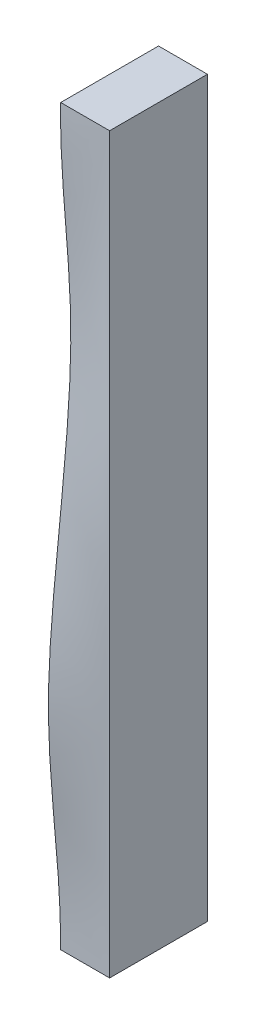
ISO-10303-21;
HEADER;
FILE_DESCRIPTION(('STEP AP214'),'2;1');
FILE_NAME('part.step','',(''),(''),'','','');
FILE_SCHEMA(('AUTOMOTIVE_DESIGN { 1 0 10303 214 1 1 1 1 }'));
ENDSEC;
DATA;
#1=APPLICATION_CONTEXT('core data for automotive mechanical design processes');
#2=APPLICATION_PROTOCOL_DEFINITION('international standard','automotive_design',2000,#1);
#3=PRODUCT_CONTEXT('',#1,'mechanical');
#4=PRODUCT('Part','Part','',(#3));
#5=PRODUCT_RELATED_PRODUCT_CATEGORY('part','',(#4));
#6=PRODUCT_DEFINITION_FORMATION('','',#4);
#7=PRODUCT_DEFINITION_CONTEXT('part definition',#1,'design');
#8=PRODUCT_DEFINITION('design','',#6,#7);
#9=PRODUCT_DEFINITION_SHAPE('','',#8);
#10=(LENGTH_UNIT() NAMED_UNIT(*) SI_UNIT(.MILLI.,.METRE.));
#11=(NAMED_UNIT(*) PLANE_ANGLE_UNIT() SI_UNIT($,.RADIAN.));
#12=(NAMED_UNIT(*) SI_UNIT($,.STERADIAN.) SOLID_ANGLE_UNIT());
#13=UNCERTAINTY_MEASURE_WITH_UNIT(LENGTH_MEASURE(1.E-05),#10,'distance_accuracy_value','');
#14=(GEOMETRIC_REPRESENTATION_CONTEXT(3) GLOBAL_UNCERTAINTY_ASSIGNED_CONTEXT((#13)) GLOBAL_UNIT_ASSIGNED_CONTEXT((#10,
#11,#12)) REPRESENTATION_CONTEXT('',''));
#15=CARTESIAN_POINT('',(0.,0.,0.));
#16=DIRECTION('',(0.,0.,1.));
#17=DIRECTION('',(1.,0.,0.));
#18=AXIS2_PLACEMENT_3D('',#15,#16,#17);
#19=CARTESIAN_POINT('',(750.,-375.,100.));
#20=CARTESIAN_POINT('',(750.,-302.078506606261,100.));
#21=CARTESIAN_POINT('',(750.,-224.483786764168,100.));
#22=CARTESIAN_POINT('',(750.,-61.5160152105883,100.));
#23=CARTESIAN_POINT('',(750.,39.4445673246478,100.));
#24=CARTESIAN_POINT('',(750.,211.849847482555,100.));
#25=CARTESIAN_POINT('',(750.,298.882075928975,100.));
#26=CARTESIAN_POINT('',(750.,375.,100.));
#27=CARTESIAN_POINT('',(669.085175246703,-375.,100.));
#28=CARTESIAN_POINT('',(669.085175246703,-302.078506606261,100.));
#29=CARTESIAN_POINT('',(669.085175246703,-234.282472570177,121.198481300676));
#30=CARTESIAN_POINT('',(669.085175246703,-62.2283080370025,120.288550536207));
#31=CARTESIAN_POINT('',(669.085175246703,68.0647781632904,82.7868169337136));
#32=CARTESIAN_POINT('',(669.085175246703,240.312514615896,73.0426687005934));
#33=CARTESIAN_POINT('',(669.085175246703,298.882075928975,100.));
#34=CARTESIAN_POINT('',(669.085175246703,375.,100.));
#35=CARTESIAN_POINT('',(500.445116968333,-375.,100.));
#36=CARTESIAN_POINT('',(517.991528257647,-284.627602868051,95.5040591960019));
#37=CARTESIAN_POINT('',(530.038001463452,-221.673003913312,150.719602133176));
#38=CARTESIAN_POINT('',(473.74510655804,-71.7416270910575,167.060530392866));
#39=CARTESIAN_POINT('',(387.213321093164,45.6135081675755,91.591323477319));
#40=CARTESIAN_POINT('',(378.694107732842,207.638743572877,66.6461848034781));
#41=CARTESIAN_POINT('',(433.17831170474,253.396603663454,122.492891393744));
#42=CARTESIAN_POINT('',(500.445116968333,375.,100.));
#43=CARTESIAN_POINT('',(285.091607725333,-375.,100.));
#44=CARTESIAN_POINT('',(309.270321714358,-264.297524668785,86.4064578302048));
#45=CARTESIAN_POINT('',(325.856840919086,-200.08226970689,164.07204721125));
#46=CARTESIAN_POINT('',(247.47112957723,-80.9425320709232,234.992870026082));
#47=CARTESIAN_POINT('',(127.240382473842,2.40271344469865,186.756001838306));
#48=CARTESIAN_POINT('',(115.567806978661,152.518027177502,151.057444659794));
#49=CARTESIAN_POINT('',(191.428893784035,202.025100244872,189.039851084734));
#50=CARTESIAN_POINT('',(285.091607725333,375.,100.));
#51=CARTESIAN_POINT('',(47.4554331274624,-375.,100.));
#52=CARTESIAN_POINT('',(51.0669239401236,-278.639867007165,99.5141662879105));
#53=CARTESIAN_POINT('',(52.9210710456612,-231.452124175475,201.325948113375));
#54=CARTESIAN_POINT('',(3.18149891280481,-90.8615864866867,272.445475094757));
#55=CARTESIAN_POINT('',(-61.0346058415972,45.7948958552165,186.157760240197));
#56=CARTESIAN_POINT('',(-59.6612105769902,205.286893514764,133.941969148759));
#57=CARTESIAN_POINT('',(-11.8049718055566,220.40073671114,189.8209162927));
#58=CARTESIAN_POINT('',(47.4554331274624,375.,100.));
#59=CARTESIAN_POINT('',(-175.903454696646,-375.,100.));
#60=CARTESIAN_POINT('',(-199.823715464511,-320.588060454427,126.731848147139));
#61=CARTESIAN_POINT('',(-216.967937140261,-300.821135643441,242.921959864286));
#62=CARTESIAN_POINT('',(-184.265304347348,-55.1410097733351,206.147478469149));
#63=CARTESIAN_POINT('',(-119.865061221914,249.096629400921,-32.5779079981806));
#64=CARTESIAN_POINT('',(-104.641938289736,431.262460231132,-94.4845569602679));
#65=CARTESIAN_POINT('',(-136.623034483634,348.137040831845,60.785640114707));
#66=CARTESIAN_POINT('',(-175.903454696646,375.,100.));
#67=CARTESIAN_POINT('',(-355.235514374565,-375.,100.));
#68=CARTESIAN_POINT('',(-319.200833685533,-282.590755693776,58.2859511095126));
#69=CARTESIAN_POINT('',(-293.075279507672,-226.888141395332,104.97090627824));
#70=CARTESIAN_POINT('',(-324.119079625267,-68.6572837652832,122.102733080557));
#71=CARTESIAN_POINT('',(-398.972481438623,73.039345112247,53.3701087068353));
#72=CARTESIAN_POINT('',(-423.398679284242,233.384819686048,47.4380317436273));
#73=CARTESIAN_POINT('',(-392.720188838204,253.575952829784,124.952096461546));
#74=CARTESIAN_POINT('',(-355.235514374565,375.,100.));
#75=CARTESIAN_POINT('',(-536.684515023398,-375.,100.));
#76=CARTESIAN_POINT('',(-494.827225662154,-277.129657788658,52.0422385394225));
#77=CARTESIAN_POINT('',(-464.573647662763,-205.017596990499,67.039018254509));
#78=CARTESIAN_POINT('',(-506.334367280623,-72.2467511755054,96.5036749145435));
#79=CARTESIAN_POINT('',(-600.216684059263,9.35641022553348,95.9941925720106));
#80=CARTESIAN_POINT('',(-628.122542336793,166.946160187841,106.349064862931));
#81=CARTESIAN_POINT('',(-587.011939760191,237.095914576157,138.331902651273));
#82=CARTESIAN_POINT('',(-536.684515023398,375.,100.));
#83=CARTESIAN_POINT('',(-644.685568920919,-375.,100.));
#84=CARTESIAN_POINT('',(-644.685568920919,-302.078506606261,100.));
#85=CARTESIAN_POINT('',(-644.685568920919,-237.237234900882,127.59081546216));
#86=CARTESIAN_POINT('',(-644.685568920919,-62.4430976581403,126.406497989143));
#87=CARTESIAN_POINT('',(-644.685568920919,76.6951111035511,77.5962366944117));
#88=CARTESIAN_POINT('',(-644.685568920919,248.895340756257,64.9137717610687));
#89=CARTESIAN_POINT('',(-644.685568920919,298.882075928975,100.));
#90=CARTESIAN_POINT('',(-644.685568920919,375.,100.));
#91=CARTESIAN_POINT('',(-750.,-375.,100.));
#92=CARTESIAN_POINT('',(-750.,-302.078506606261,100.));
#93=CARTESIAN_POINT('',(-750.,-224.483786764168,100.));
#94=CARTESIAN_POINT('',(-750.,-61.5160152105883,100.));
#95=CARTESIAN_POINT('',(-750.,39.4445673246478,100.));
#96=CARTESIAN_POINT('',(-750.,211.849847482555,100.));
#97=CARTESIAN_POINT('',(-750.,298.882075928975,100.));
#98=CARTESIAN_POINT('',(-750.,375.,100.));
#99=B_SPLINE_SURFACE_WITH_KNOTS('',3,3,((#19,#20,#21,#22,#23,#24,#25,#26),(#27,#28,#29,#30,#31,
#32,#33,#34),(#35,#36,#37,#38,#39,#40,#41,#42),(#43,#44,#45,#46,#47,#48,#49,#50),(#51,#52,#53,
#54,#55,#56,#57,#58),(#59,#60,#61,#62,#63,#64,#65,#66),(#67,#68,#69,#70,#71,#72,#73,#74),(#75,
#76,#77,#78,#79,#80,#81,#82),(#83,#84,#85,#86,#87,#88,#89,#90),(#91,#92,#93,#94,#95,#96,#97,
#98)),.UNSPECIFIED.,.F.,.F.,.F.,(4,1,1,1,1,1,1,4),(4,1,1,1,1,4),(0.,0.161829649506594,
0.33728011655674,0.430707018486,0.637101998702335,0.783997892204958,0.789371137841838,1.),(0.,
0.291685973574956,0.310378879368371,0.65187108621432,0.695528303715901,1.),.UNSPECIFIED.);
#100=CARTESIAN_POINT('',(700.,-375.,100.));
#101=CARTESIAN_POINT('',(700.,-372.256654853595,99.9902851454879));
#102=CARTESIAN_POINT('',(700.,-369.513273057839,99.9970825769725));
#103=CARTESIAN_POINT('',(700.,-364.027515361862,100.041957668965));
#104=CARTESIAN_POINT('',(700.,-361.285139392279,100.080026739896));
#105=CARTESIAN_POINT('',(700.,-355.801420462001,100.185688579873));
#106=CARTESIAN_POINT('',(700.,-353.06007740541,100.253276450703));
#107=CARTESIAN_POINT('',(700.,-347.578432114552,100.41604492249));
#108=CARTESIAN_POINT('',(700.,-344.838129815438,100.511223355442));
#109=CARTESIAN_POINT('',(700.,-339.358574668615,100.727119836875));
#110=CARTESIAN_POINT('',(700.,-336.619321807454,100.847837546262));
#111=CARTESIAN_POINT('',(700.,-331.145445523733,101.112453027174));
#112=CARTESIAN_POINT('',(700.,-328.410820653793,101.256321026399));
#113=CARTESIAN_POINT('',(700.,-322.942637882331,101.565044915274));
#114=CARTESIAN_POINT('',(700.,-320.20908003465,101.729901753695));
#115=CARTESIAN_POINT('',(700.,-314.743028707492,102.078179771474));
#116=CARTESIAN_POINT('',(700.,-312.010535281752,102.261601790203));
#117=CARTESIAN_POINT('',(700.,-306.546602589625,102.644475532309));
#118=CARTESIAN_POINT('',(700.,-303.815163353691,102.843927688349));
#119=CARTESIAN_POINT('',(700.,-298.353322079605,103.256225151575));
#120=CARTESIAN_POINT('',(700.,-295.622920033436,103.469070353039));
#121=CARTESIAN_POINT('',(700.,-289.483600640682,103.959741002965));
#122=CARTESIAN_POINT('',(700.,-286.0749230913,104.240555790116));
#123=CARTESIAN_POINT('',(700.,-279.258625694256,104.813401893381));
#124=CARTESIAN_POINT('',(700.,-275.851005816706,105.105432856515));
#125=CARTESIAN_POINT('',(700.,-269.036290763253,105.695149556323));
#126=CARTESIAN_POINT('',(700.,-265.629195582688,105.992835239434));
#127=CARTESIAN_POINT('',(700.,-258.814991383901,106.588219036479));
#128=CARTESIAN_POINT('',(700.,-255.407882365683,106.885917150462));
#129=CARTESIAN_POINT('',(700.,-248.592181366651,107.475734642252));
#130=CARTESIAN_POINT('',(700.,-245.183589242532,107.767852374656));
#131=CARTESIAN_POINT('',(700.,-238.36543813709,108.340766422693));
#132=CARTESIAN_POINT('',(700.,-234.955879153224,108.621562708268));
#133=CARTESIAN_POINT('',(700.,-228.135393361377,109.166263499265));
#134=CARTESIAN_POINT('',(700.,-224.724466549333,109.430167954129));
#135=CARTESIAN_POINT('',(700.,-217.900852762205,109.935662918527));
#136=CARTESIAN_POINT('',(700.,-214.488165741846,110.177252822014));
#137=CARTESIAN_POINT('',(700.,-208.339395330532,110.587613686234));
#138=CARTESIAN_POINT('',(700.,-205.603641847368,110.761314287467));
#139=CARTESIAN_POINT('',(700.,-200.130881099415,111.08847560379));
#140=CARTESIAN_POINT('',(700.,-197.393873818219,111.241936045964));
#141=CARTESIAN_POINT('',(700.,-191.918715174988,111.526174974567));
#142=CARTESIAN_POINT('',(700.,-189.18056383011,111.656953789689));
#143=CARTESIAN_POINT('',(700.,-183.703233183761,111.893540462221));
#144=CARTESIAN_POINT('',(700.,-180.964053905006,111.999348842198));
#145=CARTESIAN_POINT('',(700.,-175.484792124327,112.183871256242));
#146=CARTESIAN_POINT('',(700.,-172.744709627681,112.262585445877));
#147=CARTESIAN_POINT('',(700.,-167.265168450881,112.390941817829));
#148=CARTESIAN_POINT('',(700.,-164.525710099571,112.440597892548));
#149=CARTESIAN_POINT('',(700.,-159.046344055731,112.509139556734));
#150=CARTESIAN_POINT('',(700.,-156.306436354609,112.528024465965));
#151=CARTESIAN_POINT('',(700.,-150.826585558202,112.533457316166));
#152=CARTESIAN_POINT('',(700.,-148.086642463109,112.520005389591));
#153=CARTESIAN_POINT('',(700.,-143.977040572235,112.474464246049));
#154=CARTESIAN_POINT('',(700.,-142.607231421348,112.45505679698));
#155=CARTESIAN_POINT('',(700.,-139.867752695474,112.408079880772));
#156=CARTESIAN_POINT('',(700.,-138.498083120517,112.380510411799));
#157=CARTESIAN_POINT('',(700.,-134.389449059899,112.286121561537));
#158=CARTESIAN_POINT('',(700.,-131.650749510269,112.207620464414));
#159=CARTESIAN_POINT('',(700.,-124.350880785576,111.96047211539));
#160=CARTESIAN_POINT('',(700.,-119.790561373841,111.766605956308));
#161=CARTESIAN_POINT('',(700.,-110.673077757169,111.311775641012));
#162=CARTESIAN_POINT('',(700.,-106.115913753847,111.050807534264));
#163=CARTESIAN_POINT('',(700.,-97.0045523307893,110.472397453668));
#164=CARTESIAN_POINT('',(700.,-92.4503554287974,110.154947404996));
#165=CARTESIAN_POINT('',(700.,-83.3448472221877,109.473268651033));
#166=CARTESIAN_POINT('',(700.,-78.7935364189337,109.109033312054));
#167=CARTESIAN_POINT('',(700.,-69.6937721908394,108.342661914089));
#168=CARTESIAN_POINT('',(700.,-65.1453190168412,107.940522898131));
#169=CARTESIAN_POINT('',(700.,-56.0512975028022,107.106525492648));
#170=CARTESIAN_POINT('',(700.,-51.5057290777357,106.674668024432));
#171=CARTESIAN_POINT('',(700.,-42.4107873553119,105.788164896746));
#172=CARTESIAN_POINT('',(700.,-37.8614169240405,105.333489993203));
#173=CARTESIAN_POINT('',(700.,-28.7648254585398,104.408979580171));
#174=CARTESIAN_POINT('',(700.,-24.2176042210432,103.939146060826));
#175=CARTESIAN_POINT('',(700.,-15.1244513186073,102.990933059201));
#176=CARTESIAN_POINT('',(700.,-10.5785195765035,102.512554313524));
#177=CARTESIAN_POINT('',(700.,-1.48711894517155,101.553552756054));
#178=CARTESIAN_POINT('',(700.,3.05834995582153,101.072930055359));
#179=CARTESIAN_POINT('',(700.,12.149627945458,100.1155242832));
#180=CARTESIAN_POINT('',(700.,16.6954370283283,99.6387411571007));
#181=CARTESIAN_POINT('',(700.,25.7881871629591,98.6949703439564));
#182=CARTESIAN_POINT('',(700.,30.3351282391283,98.2279828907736));
#183=CARTESIAN_POINT('',(700.,37.6066560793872,97.4938952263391));
#184=CARTESIAN_POINT('',(700.,40.3307323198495,97.2217439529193));
#185=CARTESIAN_POINT('',(700.,45.779638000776,96.6843723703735));
#186=CARTESIAN_POINT('',(700.,48.5044674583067,96.4191522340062));
#187=CARTESIAN_POINT('',(700.,53.9549498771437,95.8969487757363));
#188=CARTESIAN_POINT('',(700.,56.6806028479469,95.6399655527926));
#189=CARTESIAN_POINT('',(700.,62.1328048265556,95.1355641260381));
#190=CARTESIAN_POINT('',(700.,64.8593538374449,94.8881459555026));
#191=CARTESIAN_POINT('',(700.,70.3134233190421,94.4042333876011));
#192=CARTESIAN_POINT('',(700.,73.0409437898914,94.1677389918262));
#193=CARTESIAN_POINT('',(700.,78.4958655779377,93.7071711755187));
#194=CARTESIAN_POINT('',(700.,81.223266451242,93.4830925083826));
#195=CARTESIAN_POINT('',(700.,86.6791605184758,93.0486963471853));
#196=CARTESIAN_POINT('',(700.,89.407653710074,92.8383788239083));
#197=CARTESIAN_POINT('',(700.,94.8657795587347,92.4330143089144));
#198=CARTESIAN_POINT('',(700.,97.5954122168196,92.2379673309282));
#199=CARTESIAN_POINT('',(700.,103.055869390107,91.864725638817));
#200=CARTESIAN_POINT('',(700.,105.786693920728,91.6865311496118));
#201=CARTESIAN_POINT('',(700.,111.249593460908,91.348661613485));
#202=CARTESIAN_POINT('',(700.,113.981668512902,91.1889872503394));
#203=CARTESIAN_POINT('',(700.,119.451267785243,90.8897039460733));
#204=CARTESIAN_POINT('',(700.,122.188793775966,90.750127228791));
#205=CARTESIAN_POINT('',(700.,127.66492690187,90.493233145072));
#206=CARTESIAN_POINT('',(700.,130.403534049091,90.3759160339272));
#207=CARTESIAN_POINT('',(700.,135.881621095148,90.165755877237));
#208=CARTESIAN_POINT('',(700.,138.6211009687,90.0729121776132));
#209=CARTESIAN_POINT('',(700.,144.100730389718,89.9141263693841));
#210=CARTESIAN_POINT('',(700.,146.840879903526,89.8481831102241));
#211=CARTESIAN_POINT('',(700.,152.321656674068,89.7457929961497));
#212=CARTESIAN_POINT('',(700.,155.062283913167,89.7093452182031));
#213=CARTESIAN_POINT('',(700.,160.543519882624,89.6689679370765));
#214=CARTESIAN_POINT('',(700.,163.284128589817,89.6650353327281));
#215=CARTESIAN_POINT('',(700.,168.765297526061,89.6882229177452));
#216=CARTESIAN_POINT('',(700.,171.505857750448,89.7153441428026));
#217=CARTESIAN_POINT('',(700.,176.986630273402,89.7988161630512));
#218=CARTESIAN_POINT('',(700.,179.726842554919,89.8551680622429));
#219=CARTESIAN_POINT('',(700.,185.206620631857,89.9951545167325));
#220=CARTESIAN_POINT('',(700.,187.946186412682,90.078789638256));
#221=CARTESIAN_POINT('',(700.,193.424374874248,90.2712066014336));
#222=CARTESIAN_POINT('',(700.,196.162997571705,90.3799879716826));
#223=CARTESIAN_POINT('',(700.,202.572522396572,90.6613918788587));
#224=CARTESIAN_POINT('',(700.,206.243023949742,90.8431366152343));
#225=CARTESIAN_POINT('',(700.,213.582000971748,91.2417946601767));
#226=CARTESIAN_POINT('',(700.,217.250476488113,91.4587071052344));
#227=CARTESIAN_POINT('',(700.,224.585611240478,91.9213146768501));
#228=CARTESIAN_POINT('',(700.,228.252270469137,92.1670099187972));
#229=CARTESIAN_POINT('',(700.,235.583999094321,92.6804086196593));
#230=CARTESIAN_POINT('',(700.,239.249068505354,92.9481118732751));
#231=CARTESIAN_POINT('',(700.,246.578948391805,93.4985029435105));
#232=CARTESIAN_POINT('',(700.,250.243758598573,93.7811943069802));
#233=CARTESIAN_POINT('',(700.,257.572732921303,94.3541568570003));
#234=CARTESIAN_POINT('',(700.,261.236897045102,94.6444279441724));
#235=CARTESIAN_POINT('',(700.,268.565280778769,95.2250480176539));
#236=CARTESIAN_POINT('',(700.,272.22950038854,95.5153970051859));
#237=CARTESIAN_POINT('',(700.,279.558703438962,96.0885873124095));
#238=CARTESIAN_POINT('',(700.,283.223686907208,96.3714282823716));
#239=CARTESIAN_POINT('',(700.,290.552761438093,96.9218464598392));
#240=CARTESIAN_POINT('',(700.,294.216851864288,97.189432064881));
#241=CARTESIAN_POINT('',(700.,301.546594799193,97.7020296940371));
#242=CARTESIAN_POINT('',(700.,305.21224729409,97.94704191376));
#243=CARTESIAN_POINT('',(700.,312.545184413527,98.4071961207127));
#244=CARTESIAN_POINT('',(700.,316.212468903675,98.6223402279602));
#245=CARTESIAN_POINT('',(700.,323.548721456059,99.0157698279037));
#246=CARTESIAN_POINT('',(700.,327.217689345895,99.1940584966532));
#247=CARTESIAN_POINT('',(700.,334.560235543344,99.5073115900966));
#248=CARTESIAN_POINT('',(700.,338.233815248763,99.6422436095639));
#249=CARTESIAN_POINT('',(700.,345.582699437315,99.8624543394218));
#250=CARTESIAN_POINT('',(700.,349.258004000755,99.9477304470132));
#251=CARTESIAN_POINT('',(700.,354.772011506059,100.034217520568));
#252=CARTESIAN_POINT('',(700.,356.610404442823,100.056142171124));
#253=CARTESIAN_POINT('',(700.,360.287307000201,100.085540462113));
#254=CARTESIAN_POINT('',(700.,362.125816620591,100.093014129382));
#255=CARTESIAN_POINT('',(700.,365.803686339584,100.0929042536));
#256=CARTESIAN_POINT('',(700.,367.643046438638,100.085313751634));
#257=CARTESIAN_POINT('',(700.,371.321648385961,100.054510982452));
#258=CARTESIAN_POINT('',(700.,373.160890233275,100.031298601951));
#259=CARTESIAN_POINT('',(700.,375.,100.));
#260=B_SPLINE_CURVE_WITH_KNOTS('',3,(#100,#101,#102,#103,#104,#105,#106,#107,#108,#109,#110,
#111,#112,#113,#114,#115,#116,#117,#118,#119,#120,#121,#122,#123,#124,#125,#126,#127,#128,#129,
#130,#131,#132,#133,#134,#135,#136,#137,#138,#139,#140,#141,#142,#143,#144,#145,#146,#147,#148,
#149,#150,#151,#152,#153,#154,#155,#156,#157,#158,#159,#160,#161,#162,#163,#164,#165,#166,#167,
#168,#169,#170,#171,#172,#173,#174,#175,#176,#177,#178,#179,#180,#181,#182,#183,#184,#185,#186,
#187,#188,#189,#190,#191,#192,#193,#194,#195,#196,#197,#198,#199,#200,#201,#202,#203,#204,#205,
#206,#207,#208,#209,#210,#211,#212,#213,#214,#215,#216,#217,#218,#219,#220,#221,#222,#223,#224,
#225,#226,#227,#228,#229,#230,#231,#232,#233,#234,#235,#236,#237,#238,#239,#240,#241,#242,#243,
#244,#245,#246,#247,#248,#249,#250,#251,#252,#253,#254,#255,#256,#257,#258,#259),.UNSPECIFIED.,
.F.,.F.,(4,2,2,2,2,2,2,2,2,2,2,2,2,2,2,2,2,2,2,2,2,2,2,2,2,2,2,2,2,2,2,2,2,2,2,2,2,2,2,2,2,2,2,
2,2,2,2,2,2,2,2,2,2,2,2,2,2,2,2,2,2,2,2,2,2,2,2,2,2,2,2,2,2,2,2,2,2,2,2,4),(0.,8.23000557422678,
16.4577513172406,24.6841323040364,32.9098670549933,41.1354925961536,49.3506229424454,
57.5661247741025,65.7819982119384,73.9980934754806,82.2141238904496,92.4747686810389,
102.735090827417,112.995315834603,123.255585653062,133.518835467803,143.782112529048,
154.045420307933,164.309006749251,172.532729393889,180.756562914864,188.980277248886,
197.203819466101,205.427314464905,213.646874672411,221.866616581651,230.086324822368,
234.196142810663,238.305961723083,246.525270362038,260.217953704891,273.911443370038,
287.606892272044,301.30428520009,315.002747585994,328.700785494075,342.416851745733,
356.131124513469,369.844220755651,383.556645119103,397.26887401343,410.981429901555,
419.194334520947,427.407443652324,435.620651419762,443.833887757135,452.04712529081,
460.256865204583,468.46658768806,476.676317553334,484.886156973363,493.096299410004,
501.319462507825,509.542719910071,517.765757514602,525.988443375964,534.210871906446,
542.432516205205,550.654434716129,558.87666377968,567.099063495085,575.321309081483,
586.346092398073,597.370605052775,608.395161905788,619.419615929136,630.446690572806,
641.473620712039,652.500735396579,663.528362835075,674.549860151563,685.571261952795,
696.591881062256,707.611550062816,718.639436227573,729.667900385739,735.183424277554,
740.698937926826,746.217000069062,751.735102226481),.UNSPECIFIED.);
#261=CARTESIAN_POINT('',(700.,-375.,100.));
#262=VERTEX_POINT('',#261);
#263=CARTESIAN_POINT('',(700.,375.,100.));
#264=VERTEX_POINT('',#263);
#265=EDGE_CURVE('E48',#262,#264,#260,.T.);
#266=CARTESIAN_POINT('',(-750.,-375.,100.));
#267=CARTESIAN_POINT('',(-644.685568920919,-375.,100.));
#268=CARTESIAN_POINT('',(-536.684515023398,-375.,100.));
#269=CARTESIAN_POINT('',(-355.235514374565,-375.,100.));
#270=CARTESIAN_POINT('',(-175.903454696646,-375.,100.));
#271=CARTESIAN_POINT('',(47.4554331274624,-375.,100.));
#272=CARTESIAN_POINT('',(285.091607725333,-375.,100.));
#273=CARTESIAN_POINT('',(500.445116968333,-375.,100.));
#274=CARTESIAN_POINT('',(669.085175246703,-375.,100.));
#275=CARTESIAN_POINT('',(750.,-375.,100.));
#276=B_SPLINE_CURVE_WITH_KNOTS('',3,(#266,#267,#268,#269,#270,#271,#272,#273,#274,#275),
.UNSPECIFIED.,.F.,.F.,(4,1,1,1,1,1,1,4),(0.,0.210628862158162,0.216002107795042,
0.362898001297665,0.569292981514,0.66271988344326,0.838170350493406,1.),.UNSPECIFIED.);
#277=CARTESIAN_POINT('',(750.,-375.,100.));
#278=VERTEX_POINT('',#277);
#279=EDGE_CURVE('E134',#262,#278,#276,.T.);
#280=CARTESIAN_POINT('',(750.,-375.,100.));
#281=CARTESIAN_POINT('',(750.,-302.078506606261,100.));
#282=CARTESIAN_POINT('',(750.,-224.483786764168,100.));
#283=CARTESIAN_POINT('',(750.,-61.5160152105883,100.));
#284=CARTESIAN_POINT('',(750.,39.4445673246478,100.));
#285=CARTESIAN_POINT('',(750.,211.849847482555,100.));
#286=CARTESIAN_POINT('',(750.,298.882075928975,100.));
#287=CARTESIAN_POINT('',(750.,375.,100.));
#288=B_SPLINE_CURVE_WITH_KNOTS('',3,(#280,#281,#282,#283,#284,#285,#286,#287),.UNSPECIFIED.,.F.,
.F.,(4,1,1,1,1,4),(0.,0.291685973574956,0.310378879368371,0.65187108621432,0.695528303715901,
1.),.UNSPECIFIED.);
#289=CARTESIAN_POINT('',(750.,375.,100.));
#290=VERTEX_POINT('',#289);
#291=EDGE_CURVE('E140',#278,#290,#288,.T.);
#292=CARTESIAN_POINT('',(750.,375.,100.));
#293=CARTESIAN_POINT('',(669.085175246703,375.,100.));
#294=CARTESIAN_POINT('',(500.445116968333,375.,100.));
#295=CARTESIAN_POINT('',(285.091607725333,375.,100.));
#296=CARTESIAN_POINT('',(47.4554331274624,375.,100.));
#297=CARTESIAN_POINT('',(-175.903454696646,375.,100.));
#298=CARTESIAN_POINT('',(-355.235514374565,375.,100.));
#299=CARTESIAN_POINT('',(-536.684515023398,375.,100.));
#300=CARTESIAN_POINT('',(-644.685568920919,375.,100.));
#301=CARTESIAN_POINT('',(-750.,375.,100.));
#302=B_SPLINE_CURVE_WITH_KNOTS('',3,(#292,#293,#294,#295,#296,#297,#298,#299,#300,#301),
.UNSPECIFIED.,.F.,.F.,(4,1,1,1,1,1,1,4),(0.,0.161829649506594,0.33728011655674,0.430707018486,
0.637101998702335,0.783997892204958,0.789371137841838,1.),.UNSPECIFIED.);
#303=EDGE_CURVE('E89',#290,#264,#302,.T.);
#304=ORIENTED_EDGE('',*,*,#265,.F.);
#305=ORIENTED_EDGE('',*,*,#279,.T.);
#306=ORIENTED_EDGE('',*,*,#291,.T.);
#307=ORIENTED_EDGE('',*,*,#303,.T.);
#308=EDGE_LOOP('',(#304,#305,#306,#307));
#309=FACE_BOUND('',#308,.T.);
#310=ADVANCED_FACE('F35',(#309),#99,.F.);
#311=CARTESIAN_POINT('',(0.,0.,0.));
#312=DIRECTION('',(0.,0.,-1.));
#313=DIRECTION('',(-1.,0.,0.));
#314=AXIS2_PLACEMENT_3D('',#311,#312,#313);
#315=PLANE('',#314);
#316=DIRECTION('',(1.,0.,0.));
#317=VECTOR('',#316,1.);
#318=CARTESIAN_POINT('',(-750.,-375.,0.));
#319=LINE('',#318,#317);
#320=CARTESIAN_POINT('',(700.,-375.,0.));
#321=VERTEX_POINT('',#320);
#322=CARTESIAN_POINT('',(750.,-375.,0.));
#323=VERTEX_POINT('',#322);
#324=EDGE_CURVE('E88',#321,#323,#319,.T.);
#325=ORIENTED_EDGE('',*,*,#324,.F.);
#326=DIRECTION('',(0.,1.,0.));
#327=VECTOR('',#326,1.);
#328=CARTESIAN_POINT('',(700.,375.,0.));
#329=LINE('',#328,#327);
#330=CARTESIAN_POINT('',(700.,375.,0.));
#331=VERTEX_POINT('',#330);
#332=EDGE_CURVE('E76',#321,#331,#329,.T.);
#333=ORIENTED_EDGE('',*,*,#332,.T.);
#334=DIRECTION('',(-1.,0.,0.));
#335=VECTOR('',#334,1.);
#336=CARTESIAN_POINT('',(-750.,375.,0.));
#337=LINE('',#336,#335);
#338=CARTESIAN_POINT('',(750.,375.,0.));
#339=VERTEX_POINT('',#338);
#340=EDGE_CURVE('E86',#339,#331,#337,.T.);
#341=ORIENTED_EDGE('',*,*,#340,.F.);
#342=DIRECTION('',(0.,1.,0.));
#343=VECTOR('',#342,1.);
#344=CARTESIAN_POINT('',(750.,-375.,0.));
#345=LINE('',#344,#343);
#346=EDGE_CURVE('E97',#323,#339,#345,.T.);
#347=ORIENTED_EDGE('',*,*,#346,.F.);
#348=EDGE_LOOP('',(#325,#333,#341,#347));
#349=FACE_BOUND('',#348,.T.);
#350=ADVANCED_FACE('F84',(#349),#315,.T.);
#351=CARTESIAN_POINT('',(-750.,-375.,253.111113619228));
#352=DIRECTION('',(0.,1.,0.));
#353=DIRECTION('',(0.,0.,1.));
#354=AXIS2_PLACEMENT_3D('',#351,#352,#353);
#355=PLANE('',#354);
#356=DIRECTION('',(0.,0.,-1.));
#357=VECTOR('',#356,1.);
#358=CARTESIAN_POINT('',(700.,-375.,253.120113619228));
#359=LINE('',#358,#357);
#360=EDGE_CURVE('E57',#262,#321,#359,.T.);
#361=ORIENTED_EDGE('',*,*,#360,.T.);
#362=ORIENTED_EDGE('',*,*,#324,.T.);
#363=DIRECTION('',(0.,0.,-1.));
#364=VECTOR('',#363,1.);
#365=CARTESIAN_POINT('',(750.,-375.,253.111113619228));
#366=LINE('',#365,#364);
#367=EDGE_CURVE('E94',#278,#323,#366,.T.);
#368=ORIENTED_EDGE('',*,*,#367,.F.);
#369=ORIENTED_EDGE('',*,*,#279,.F.);
#370=EDGE_LOOP('',(#361,#362,#368,#369));
#371=FACE_BOUND('',#370,.T.);
#372=ADVANCED_FACE('F111',(#371),#355,.F.);
#373=CARTESIAN_POINT('',(-750.,375.,253.111113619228));
#374=DIRECTION('',(0.,-1.,0.));
#375=DIRECTION('',(0.,0.,-1.));
#376=AXIS2_PLACEMENT_3D('',#373,#374,#375);
#377=PLANE('',#376);
#378=DIRECTION('',(0.,0.,-1.));
#379=VECTOR('',#378,1.);
#380=CARTESIAN_POINT('',(700.,375.,253.111113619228));
#381=LINE('',#380,#379);
#382=EDGE_CURVE('E11',#264,#331,#381,.T.);
#383=ORIENTED_EDGE('',*,*,#382,.F.);
#384=ORIENTED_EDGE('',*,*,#303,.F.);
#385=DIRECTION('',(0.,0.,-1.));
#386=VECTOR('',#385,1.);
#387=CARTESIAN_POINT('',(750.,375.,253.111113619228));
#388=LINE('',#387,#386);
#389=EDGE_CURVE('E93',#290,#339,#388,.T.);
#390=ORIENTED_EDGE('',*,*,#389,.T.);
#391=ORIENTED_EDGE('',*,*,#340,.T.);
#392=EDGE_LOOP('',(#383,#384,#390,#391));
#393=FACE_BOUND('',#392,.T.);
#394=ADVANCED_FACE('F91',(#393),#377,.F.);
#395=CARTESIAN_POINT('',(750.,-375.,253.111113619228));
#396=DIRECTION('',(-1.,0.,0.));
#397=DIRECTION('',(0.,0.,1.));
#398=AXIS2_PLACEMENT_3D('',#395,#396,#397);
#399=PLANE('',#398);
#400=ORIENTED_EDGE('',*,*,#389,.F.);
#401=ORIENTED_EDGE('',*,*,#291,.F.);
#402=ORIENTED_EDGE('',*,*,#367,.T.);
#403=ORIENTED_EDGE('',*,*,#346,.T.);
#404=EDGE_LOOP('',(#400,#401,#402,#403));
#405=FACE_BOUND('',#404,.T.);
#406=ADVANCED_FACE('F125',(#405),#399,.F.);
#407=CARTESIAN_POINT('',(700.,375.,253.120113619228));
#408=DIRECTION('',(-1.,0.,0.));
#409=DIRECTION('',(0.,-1.,0.));
#410=AXIS2_PLACEMENT_3D('',#407,#408,#409);
#411=PLANE('',#410);
#412=ORIENTED_EDGE('',*,*,#265,.T.);
#413=ORIENTED_EDGE('',*,*,#382,.T.);
#414=ORIENTED_EDGE('',*,*,#332,.F.);
#415=ORIENTED_EDGE('',*,*,#360,.F.);
#416=EDGE_LOOP('',(#412,#413,#414,#415));
#417=FACE_BOUND('',#416,.T.);
#418=ADVANCED_FACE('F75',(#417),#411,.T.);
#419=CLOSED_SHELL('',(#310,#350,#372,#394,#406,#418));
#420=MANIFOLD_SOLID_BREP('B2',#419);
#421=ADVANCED_BREP_SHAPE_REPRESENTATION('',(#18,#420),#14);
#422=SHAPE_DEFINITION_REPRESENTATION(#9,#421);
ENDSEC;
END-ISO-10303-21;
